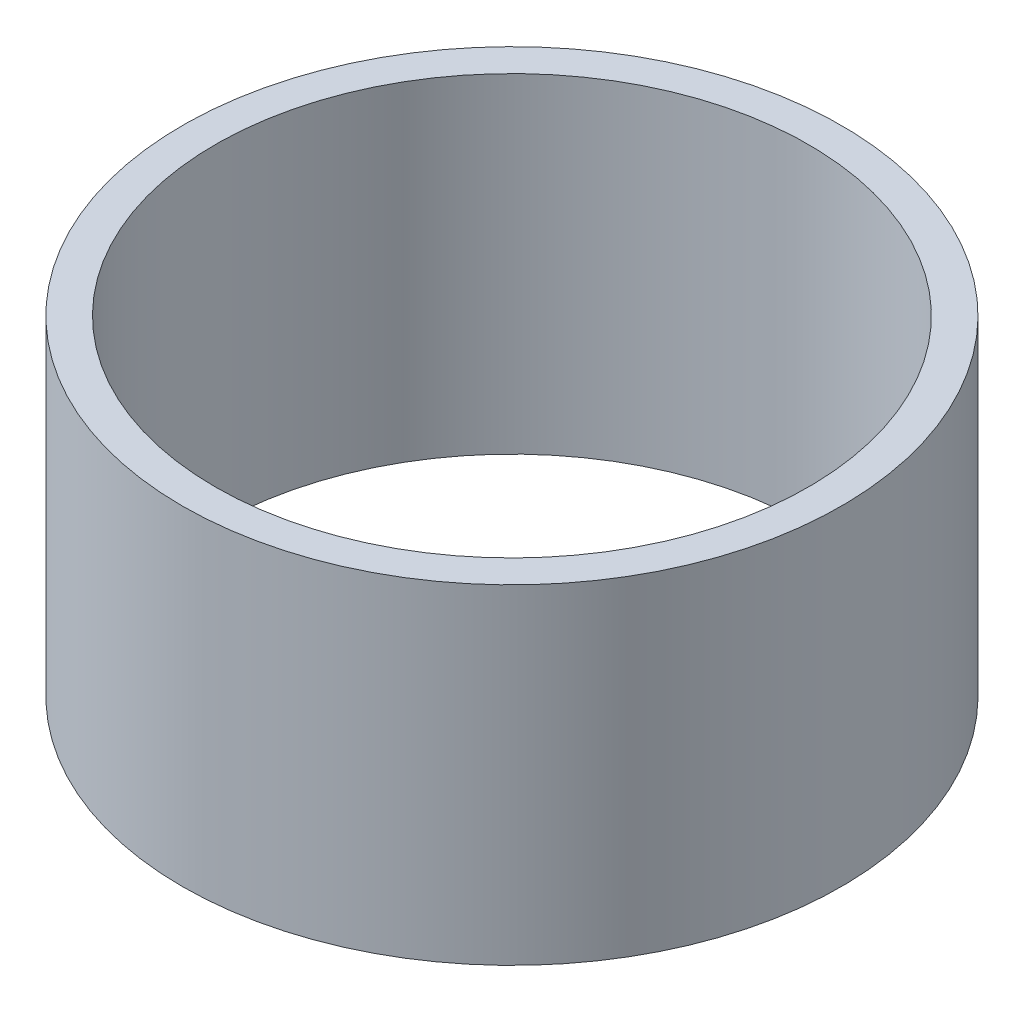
ISO-10303-21;
HEADER;
FILE_DESCRIPTION(('STEP AP214'),'2;1');
FILE_NAME('part.step','',(''),(''),'','','');
FILE_SCHEMA(('AUTOMOTIVE_DESIGN { 1 0 10303 214 1 1 1 1 }'));
ENDSEC;
DATA;
#1=APPLICATION_CONTEXT('core data for automotive mechanical design processes');
#2=APPLICATION_PROTOCOL_DEFINITION('international standard','automotive_design',2000,#1);
#3=PRODUCT_CONTEXT('',#1,'mechanical');
#4=PRODUCT('Part','Part','',(#3));
#5=PRODUCT_RELATED_PRODUCT_CATEGORY('part','',(#4));
#6=PRODUCT_DEFINITION_FORMATION('','',#4);
#7=PRODUCT_DEFINITION_CONTEXT('part definition',#1,'design');
#8=PRODUCT_DEFINITION('design','',#6,#7);
#9=PRODUCT_DEFINITION_SHAPE('','',#8);
#10=(LENGTH_UNIT() NAMED_UNIT(*) SI_UNIT(.MILLI.,.METRE.));
#11=(NAMED_UNIT(*) PLANE_ANGLE_UNIT() SI_UNIT($,.RADIAN.));
#12=(NAMED_UNIT(*) SI_UNIT($,.STERADIAN.) SOLID_ANGLE_UNIT());
#13=UNCERTAINTY_MEASURE_WITH_UNIT(LENGTH_MEASURE(1.E-05),#10,'distance_accuracy_value','');
#14=(GEOMETRIC_REPRESENTATION_CONTEXT(3) GLOBAL_UNCERTAINTY_ASSIGNED_CONTEXT((#13)) GLOBAL_UNIT_ASSIGNED_CONTEXT((#10,
#11,#12)) REPRESENTATION_CONTEXT('',''));
#15=CARTESIAN_POINT('',(0.,0.,0.));
#16=DIRECTION('',(0.,0.,1.));
#17=DIRECTION('',(1.,0.,0.));
#18=AXIS2_PLACEMENT_3D('',#15,#16,#17);
#19=CARTESIAN_POINT('',(0.,50.,0.));
#20=DIRECTION('',(0.,1.,0.));
#21=DIRECTION('',(0.,0.,1.));
#22=AXIS2_PLACEMENT_3D('',#19,#20,#21);
#23=PLANE('',#22);
#24=CARTESIAN_POINT('',(0.,50.,0.));
#25=DIRECTION('',(0.,1.,0.));
#26=DIRECTION('',(0.,0.,1.));
#27=AXIS2_PLACEMENT_3D('',#24,#25,#26);
#28=CIRCLE('',#27,100.);
#29=CARTESIAN_POINT('',(0.,50.,100.));
#30=VERTEX_POINT('',#29);
#31=EDGE_CURVE('E10',#30,#30,#28,.T.);
#32=ORIENTED_EDGE('',*,*,#31,.T.);
#33=EDGE_LOOP('',(#32));
#34=FACE_BOUND('',#33,.T.);
#35=CARTESIAN_POINT('',(0.,50.,0.));
#36=DIRECTION('',(0.,1.,0.));
#37=DIRECTION('',(0.,0.,1.));
#38=AXIS2_PLACEMENT_3D('',#35,#36,#37);
#39=CIRCLE('',#38,90.);
#40=CARTESIAN_POINT('',(0.,50.,90.));
#41=VERTEX_POINT('',#40);
#42=EDGE_CURVE('E35',#41,#41,#39,.T.);
#43=ORIENTED_EDGE('',*,*,#42,.F.);
#44=EDGE_LOOP('',(#43));
#45=FACE_BOUND('',#44,.T.);
#46=ADVANCED_FACE('F24',(#34,#45),#23,.T.);
#47=CARTESIAN_POINT('',(0.,-50.,0.));
#48=DIRECTION('',(0.,1.,0.));
#49=DIRECTION('',(0.,0.,1.));
#50=AXIS2_PLACEMENT_3D('',#47,#48,#49);
#51=PLANE('',#50);
#52=CARTESIAN_POINT('',(0.,-50.,0.));
#53=DIRECTION('',(0.,1.,0.));
#54=DIRECTION('',(0.,0.,1.));
#55=AXIS2_PLACEMENT_3D('',#52,#53,#54);
#56=CIRCLE('',#55,100.);
#57=CARTESIAN_POINT('',(0.,-50.,100.));
#58=VERTEX_POINT('',#57);
#59=EDGE_CURVE('E31',#58,#58,#56,.T.);
#60=ORIENTED_EDGE('',*,*,#59,.F.);
#61=EDGE_LOOP('',(#60));
#62=FACE_BOUND('',#61,.T.);
#63=CARTESIAN_POINT('',(0.,-50.,0.));
#64=DIRECTION('',(0.,1.,0.));
#65=DIRECTION('',(0.,0.,1.));
#66=AXIS2_PLACEMENT_3D('',#63,#64,#65);
#67=CIRCLE('',#66,90.);
#68=CARTESIAN_POINT('',(0.,-50.,90.));
#69=VERTEX_POINT('',#68);
#70=EDGE_CURVE('E39',#69,#69,#67,.T.);
#71=ORIENTED_EDGE('',*,*,#70,.T.);
#72=EDGE_LOOP('',(#71));
#73=FACE_BOUND('',#72,.T.);
#74=ADVANCED_FACE('F45',(#62,#73),#51,.F.);
#75=CARTESIAN_POINT('',(0.,50.,0.));
#76=DIRECTION('',(0.,-1.,0.));
#77=DIRECTION('',(0.,0.,-1.));
#78=AXIS2_PLACEMENT_3D('',#75,#76,#77);
#79=CYLINDRICAL_SURFACE('',#78,100.);
#80=ORIENTED_EDGE('',*,*,#31,.F.);
#81=EDGE_LOOP('',(#80));
#82=FACE_BOUND('',#81,.T.);
#83=ORIENTED_EDGE('',*,*,#59,.T.);
#84=EDGE_LOOP('',(#83));
#85=FACE_BOUND('',#84,.T.);
#86=ADVANCED_FACE('F26',(#82,#85),#79,.T.);
#87=CARTESIAN_POINT('',(0.,50.,0.));
#88=DIRECTION('',(0.,-1.,0.));
#89=DIRECTION('',(0.,0.,-1.));
#90=AXIS2_PLACEMENT_3D('',#87,#88,#89);
#91=CYLINDRICAL_SURFACE('',#90,90.);
#92=ORIENTED_EDGE('',*,*,#42,.T.);
#93=EDGE_LOOP('',(#92));
#94=FACE_BOUND('',#93,.T.);
#95=ORIENTED_EDGE('',*,*,#70,.F.);
#96=EDGE_LOOP('',(#95));
#97=FACE_BOUND('',#96,.T.);
#98=ADVANCED_FACE('F47',(#94,#97),#91,.F.);
#99=CLOSED_SHELL('',(#46,#74,#86,#98));
#100=MANIFOLD_SOLID_BREP('B2',#99);
#101=ADVANCED_BREP_SHAPE_REPRESENTATION('',(#18,#100),#14);
#102=SHAPE_DEFINITION_REPRESENTATION(#9,#101);
ENDSEC;
END-ISO-10303-21;
